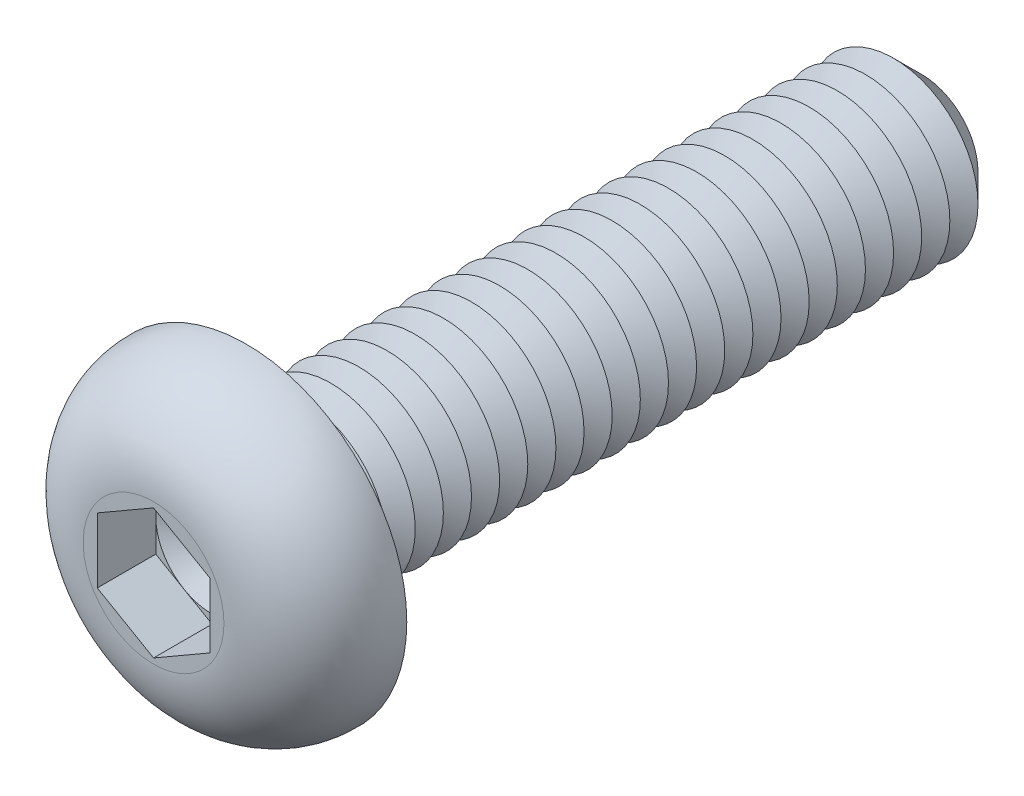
from build123d import *

# Parameters (mm, degrees)
CUT_EXTRUDE1_DEPTH  = 1.04
SKETCH4_R           = 1.5
BOSS_EXTRUDE1_DEPTH = 12
CHAMFER1_SIZE       = 0.5
LPATTERN1_COUNT     = 22
LPATTERN1_PITCH     = 0.5
FILLET2_R           = 0.2


with BuildPart() as part:
    # Sketch2 → Revolve1 (revolve)
    with BuildSketch(Plane(origin=(0, 0, 0), x_dir=(0, 0, -1), z_dir=(1, 0, 0)), mode=Mode.PRIVATE) as revolve1_sk:
        with BuildLine():
            Line((0, 0), (-1.65, 0))
            Line((-1.65, 0), (-1.65, 1.250781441))
            ThreePointArc((-1.65, 1.250781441), (-1.163552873, 2.39969397), (0, 2.85))
            Line((0, 2.85), (0, 0))
        make_face()
    revolve(revolve1_sk.sketch.rotate(Axis((0, 0, 47.934239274), (0, 0, -1)), 90), axis=Axis((0, 0, 47.934239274), (0, 0, -1)))

    # Sketch3 → Cut-Extrude1 (cut)
    with BuildSketch(Plane.XY.offset(1.65)):
        Polygon((0, 1.154700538), (-1, 0.577350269), (-1, -0.577350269), (0, -1.154700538), (1, -0.577350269), (1, 0.577350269), align=None)
    extrude(amount=-CUT_EXTRUDE1_DEPTH, mode=Mode.SUBTRACT)

    # Sketch4 → Boss-Extrude1 (add)
    with BuildSketch(Plane(origin=(0, 0, 0), x_dir=(-1, 0, 0), z_dir=(0, 0, -1))):
        with Locations(Location((0, 0, 0), (0, 0, 180))):
            Circle(SKETCH4_R)
    extrude(amount=BOSS_EXTRUDE1_DEPTH)

    # Chamfer1
    chamfer1_edges = [part.edges().sort_by_distance(p)[0] for p in [
        (-1.5, 0, -12),
    ]]
    chamfer(chamfer1_edges, length=CHAMFER1_SIZE)

    # Sketch5 → Cut-Revolve1 (revolve, cut)
    with BuildSketch(Plane(origin=(0, 0, 0), x_dir=(0, 0, -1), z_dir=(1, 0, 0)), mode=Mode.PRIVATE) as cut_revolve1_sk:
        Polygon((0.5, 1.5), (1, 1.5), (0.75, 1.066987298), align=None)
    cut_revolve1 = revolve(cut_revolve1_sk.sketch.rotate(Axis((0, 0, 47.934239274), (0, 0, -1)), 90), axis=Axis((0, 0, 47.934239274), (0, 0, -1)), mode=Mode.SUBTRACT)

    # LPattern1: Cut-Revolve1 ×22
    with Locations(*[(0, 0, -i * LPATTERN1_PITCH) for i in range(1, LPATTERN1_COUNT)]):
        add(cut_revolve1, mode=Mode.SUBTRACT)

    # Fillet2
    fillet2_edges = [part.edges().sort_by_distance(p)[0] for p in [
        (-1.5, 0, 0),
    ]]
    fillet(fillet2_edges, radius=FILLET2_R)

    # Cut-Extrude2 cone 1 section (on through the dimple's axis) → Cut-Extrude2 (revolve, cut)
    with BuildSketch(Plane(origin=(0, 0, 0.61), x_dir=(0, -1, 0), z_dir=(1, 0, 0))):
        Polygon((0, 0), (1, 0), (0, 0.577350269), align=None)
    revolve(axis=Axis((0, 0, 0.61), (0, 0, -1)), mode=Mode.SUBTRACT)


solid = part.part
